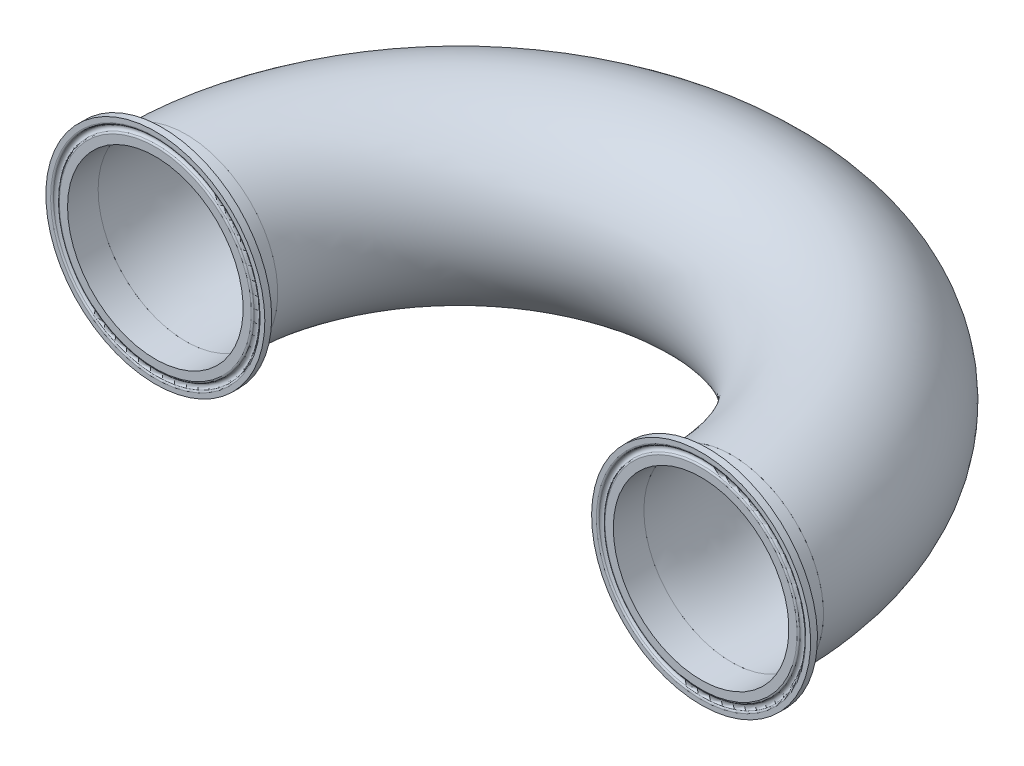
ISO-10303-21;
HEADER;
FILE_DESCRIPTION(('STEP AP214'),'2;1');
FILE_NAME('part.step','',(''),(''),'','','');
FILE_SCHEMA(('AUTOMOTIVE_DESIGN { 1 0 10303 214 1 1 1 1 }'));
ENDSEC;
DATA;
#1=APPLICATION_CONTEXT('core data for automotive mechanical design processes');
#2=APPLICATION_PROTOCOL_DEFINITION('international standard','automotive_design',2000,#1);
#3=PRODUCT_CONTEXT('',#1,'mechanical');
#4=PRODUCT('Part','Part','',(#3));
#5=PRODUCT_RELATED_PRODUCT_CATEGORY('part','',(#4));
#6=PRODUCT_DEFINITION_FORMATION('','',#4);
#7=PRODUCT_DEFINITION_CONTEXT('part definition',#1,'design');
#8=PRODUCT_DEFINITION('design','',#6,#7);
#9=PRODUCT_DEFINITION_SHAPE('','',#8);
#10=(LENGTH_UNIT() NAMED_UNIT(*) SI_UNIT(.MILLI.,.METRE.));
#11=(NAMED_UNIT(*) PLANE_ANGLE_UNIT() SI_UNIT($,.RADIAN.));
#12=(NAMED_UNIT(*) SI_UNIT($,.STERADIAN.) SOLID_ANGLE_UNIT());
#13=UNCERTAINTY_MEASURE_WITH_UNIT(LENGTH_MEASURE(1.E-05),#10,'distance_accuracy_value','');
#14=(GEOMETRIC_REPRESENTATION_CONTEXT(3) GLOBAL_UNCERTAINTY_ASSIGNED_CONTEXT((#13)) GLOBAL_UNIT_ASSIGNED_CONTEXT((#10,
#11,#12)) REPRESENTATION_CONTEXT('',''));
#15=CARTESIAN_POINT('',(0.,0.,0.));
#16=DIRECTION('',(0.,0.,1.));
#17=DIRECTION('',(1.,0.,0.));
#18=AXIS2_PLACEMENT_3D('',#15,#16,#17);
#19=CARTESIAN_POINT('',(-15.1247017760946,141.014622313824,192.088696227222));
#20=DIRECTION('',(0.,0.,-1.));
#21=DIRECTION('',(-1.,0.,0.));
#22=AXIS2_PLACEMENT_3D('',#19,#20,#21);
#23=CIRCLE('',#22,38.1);
#24=CARTESIAN_POINT('',(99.1707192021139,141.014622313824,193.11180101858));
#25=DIRECTION('',(0.,-1.,0.));
#26=AXIS1_PLACEMENT('',#24,#25);
#27=SURFACE_OF_REVOLUTION('',#23,#26);
#28=CARTESIAN_POINT('',(-53.2247017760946,141.014622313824,192.088696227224));
#29=VERTEX_POINT('',#28);
#30=EDGE_CURVE('P0_E10',#29,#29,#23,.T.);
#31=ORIENTED_EDGE('',*,*,#30,.T.);
#32=EDGE_LOOP('',(#31));
#33=FACE_BOUND('',#32,.T.);
#34=CARTESIAN_POINT('',(213.466140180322,141.014622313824,194.134905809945));
#35=DIRECTION('',(0.,0.,1.));
#36=DIRECTION('',(1.,0.,0.));
#37=AXIS2_PLACEMENT_3D('',#34,#35,#36);
#38=CIRCLE('',#37,38.1);
#39=CARTESIAN_POINT('',(251.566140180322,141.014622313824,194.134905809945));
#40=VERTEX_POINT('',#39);
#41=EDGE_CURVE('P0_E22',#40,#40,#38,.T.);
#42=ORIENTED_EDGE('',*,*,#41,.F.);
#43=EDGE_LOOP('',(#42));
#44=FACE_BOUND('',#43,.T.);
#45=ADVANCED_FACE('P0_F15',(#33,#44),#27,.F.);
#46=CARTESIAN_POINT('',(-15.1247017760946,141.014622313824,192.088696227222));
#47=DIRECTION('',(0.,0.,-1.));
#48=DIRECTION('',(-1.,0.,0.));
#49=AXIS2_PLACEMENT_3D('',#46,#47,#48);
#50=PLANE('',#49);
#51=CARTESIAN_POINT('',(21.3241525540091,141.014622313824,192.088696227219));
#52=CARTESIAN_POINT('',(21.3241599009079,139.990570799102,192.088696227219));
#53=CARTESIAN_POINT('',(21.2809783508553,138.966639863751,192.088696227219));
#54=CARTESIAN_POINT('',(21.1085535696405,136.925714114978,192.088696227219));
#55=CARTESIAN_POINT('',(20.9792876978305,135.908721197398,192.088696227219));
#56=CARTESIAN_POINT('',(20.6353902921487,133.88812912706,192.088696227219));
#57=CARTESIAN_POINT('',(20.4206643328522,132.884546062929,192.088696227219));
#58=CARTESIAN_POINT('',(19.9073961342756,130.899113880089,192.08869622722));
#59=CARTESIAN_POINT('',(19.6088594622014,129.917263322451,192.08869622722));
#60=CARTESIAN_POINT('',(18.9302418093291,127.982659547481,192.08869622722));
#61=CARTESIAN_POINT('',(18.5501977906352,127.029893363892,192.08869622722));
#62=CARTESIAN_POINT('',(17.7111815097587,125.159752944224,192.08869622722));
#63=CARTESIAN_POINT('',(17.252208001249,124.242379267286,192.08869622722));
#64=CARTESIAN_POINT('',(16.2587274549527,122.449792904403,192.08869622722));
#65=CARTESIAN_POINT('',(15.724239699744,121.574569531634,192.08869622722));
#66=CARTESIAN_POINT('',(14.5834435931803,119.872257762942,192.08869622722));
#67=CARTESIAN_POINT('',(13.9771355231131,119.045169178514,192.08869622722));
#68=CARTESIAN_POINT('',(12.6969414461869,117.444920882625,192.08869622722));
#69=CARTESIAN_POINT('',(12.0230485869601,116.671766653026,192.08869622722));
#70=CARTESIAN_POINT('',(10.6125262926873,115.184975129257,192.08869622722));
#71=CARTESIAN_POINT('',(9.87589679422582,114.471337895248,192.08869622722));
#72=CARTESIAN_POINT('',(8.34510877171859,113.108628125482,192.08869622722));
#73=CARTESIAN_POINT('',(7.55094801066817,112.459558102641,192.08869622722));
#74=CARTESIAN_POINT('',(5.91076923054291,111.230629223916,192.08869622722));
#75=CARTESIAN_POINT('',(5.06475122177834,110.65077035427,192.08869622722));
#76=CARTESIAN_POINT('',(3.32689369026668,109.564399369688,192.088696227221));
#77=CARTESIAN_POINT('',(2.43505526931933,109.057885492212,192.088696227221));
#78=CARTESIAN_POINT('',(0.611878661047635,108.121788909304,192.088696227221));
#79=CARTESIAN_POINT('',(-0.319459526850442,107.692206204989,192.088696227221));
#80=CARTESIAN_POINT('',(-2.21501243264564,106.91302684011,192.088696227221));
#81=CARTESIAN_POINT('',(-3.17922708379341,106.563430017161,192.088696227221));
#82=CARTESIAN_POINT('',(-5.13367971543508,105.94670668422,192.088696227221));
#83=CARTESIAN_POINT('',(-6.12391769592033,105.6795801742,192.088696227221));
#84=CARTESIAN_POINT('',(-8.12337820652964,105.229696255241,192.088696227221));
#85=CARTESIAN_POINT('',(-9.13260075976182,105.046938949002,192.088696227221));
#86=CARTESIAN_POINT('',(-11.1628542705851,104.767093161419,192.088696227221));
#87=CARTESIAN_POINT('',(-12.1838852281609,104.670004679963,192.088696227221));
#88=CARTESIAN_POINT('',(-14.2304947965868,104.562186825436,192.088696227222));
#89=CARTESIAN_POINT('',(-15.2560733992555,104.551457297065,192.088696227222));
#90=CARTESIAN_POINT('',(-17.3044888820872,104.616433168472,192.088696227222));
#91=CARTESIAN_POINT('',(-18.3273257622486,104.692138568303,192.088696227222));
#92=CARTESIAN_POINT('',(-20.3629885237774,104.929446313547,192.088696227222));
#93=CARTESIAN_POINT('',(-21.3758143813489,105.091048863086,192.088696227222));
#94=CARTESIAN_POINT('',(-23.3842520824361,105.499002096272,192.088696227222));
#95=CARTESIAN_POINT('',(-24.3798639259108,105.745352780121,192.088696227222));
#96=CARTESIAN_POINT('',(-26.346796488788,106.321051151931,192.088696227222));
#97=CARTESIAN_POINT('',(-27.3181171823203,106.650398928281,192.088696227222));
#98=CARTESIAN_POINT('',(-29.2295608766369,107.389749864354,192.088696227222));
#99=CARTESIAN_POINT('',(-30.1696838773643,107.799753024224,192.088696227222));
#100=CARTESIAN_POINT('',(-32.012050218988,108.697500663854,192.088696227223));
#101=CARTESIAN_POINT('',(-32.9142934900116,109.185245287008,192.088696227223));
#102=CARTESIAN_POINT('',(-34.6744841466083,110.235007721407,192.088696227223));
#103=CARTESIAN_POINT('',(-35.5324315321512,110.797025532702,192.088696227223));
#104=CARTESIAN_POINT('',(-37.197930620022,111.991338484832,192.088696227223));
#105=CARTESIAN_POINT('',(-38.005482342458,112.623633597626,192.088696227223));
#106=CARTESIAN_POINT('',(-39.5644493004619,113.954006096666,192.088696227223));
#107=CARTESIAN_POINT('',(-40.3158645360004,114.652083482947,192.088696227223));
#108=CARTESIAN_POINT('',(-41.7572175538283,116.109058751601,192.088696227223));
#109=CARTESIAN_POINT('',(-42.4471552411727,116.867956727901,192.088696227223));
#110=CARTESIAN_POINT('',(-43.7606468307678,118.44117692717,192.088696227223));
#111=CARTESIAN_POINT('',(-44.3842007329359,119.25549915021,192.088696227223));
#112=CARTESIAN_POINT('',(-45.5604917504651,120.933778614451,192.088696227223));
#113=CARTESIAN_POINT('',(-46.1132288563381,121.797735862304,192.088696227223));
#114=CARTESIAN_POINT('',(-47.1439565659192,123.569143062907,192.088696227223));
#115=CARTESIAN_POINT('',(-47.6219471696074,124.476593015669,192.088696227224));
#116=CARTESIAN_POINT('',(-48.4997839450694,126.328534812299,192.088696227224));
#117=CARTESIAN_POINT('',(-48.8996300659,127.273026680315,192.088696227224));
#118=CARTESIAN_POINT('',(-49.6183348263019,129.192336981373,192.088696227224));
#119=CARTESIAN_POINT('',(-49.9371934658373,130.167155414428,192.088696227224));
#120=CARTESIAN_POINT('',(-50.4916563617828,132.14018842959,192.088696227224));
#121=CARTESIAN_POINT('',(-50.7272606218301,133.138403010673,192.088696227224));
#122=CARTESIAN_POINT('',(-51.113539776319,135.15113165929,192.088696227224));
#123=CARTESIAN_POINT('',(-51.2642146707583,136.165645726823,192.088696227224));
#124=CARTESIAN_POINT('',(-51.4795639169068,138.203761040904,192.088696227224));
#125=CARTESIAN_POINT('',(-51.5442382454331,139.227362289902,192.088696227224));
#126=CARTESIAN_POINT('',(-51.587126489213,141.276374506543,192.088696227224));
#127=CARTESIAN_POINT('',(-51.5653404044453,142.301785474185,192.088696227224));
#128=CARTESIAN_POINT('',(-51.4354627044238,144.347127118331,192.088696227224));
#129=CARTESIAN_POINT('',(-51.3273710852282,145.367057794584,192.088696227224));
#130=CARTESIAN_POINT('',(-51.0256507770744,147.394187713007,192.088696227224));
#131=CARTESIAN_POINT('',(-50.8320220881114,148.401386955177,192.088696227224));
#132=CARTESIAN_POINT('',(-50.360604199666,150.395893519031,192.088696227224));
#133=CARTESIAN_POINT('',(-50.0828149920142,151.383200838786,192.088696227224));
#134=CARTESIAN_POINT('',(-49.4450509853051,153.330904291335,192.088696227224));
#135=CARTESIAN_POINT('',(-49.0850761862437,154.291300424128,192.088696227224));
#136=CARTESIAN_POINT('',(-48.2855002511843,156.178353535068,192.088696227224));
#137=CARTESIAN_POINT('',(-47.8458991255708,157.105010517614,192.088696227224));
#138=CARTESIAN_POINT('',(-46.8901958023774,158.917997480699,192.088696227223));
#139=CARTESIAN_POINT('',(-46.3740936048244,159.804327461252,192.088696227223));
#140=CARTESIAN_POINT('',(-45.2690574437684,161.530358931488,192.088696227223));
#141=CARTESIAN_POINT('',(-44.6801234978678,162.370060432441,192.088696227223));
#142=CARTESIAN_POINT('',(-43.4336107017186,163.996865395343,192.088696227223));
#143=CARTESIAN_POINT('',(-42.7760318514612,164.783968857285,192.088696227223));
#144=CARTESIAN_POINT('',(-41.3969039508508,166.299982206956,192.088696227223));
#145=CARTESIAN_POINT('',(-40.6753548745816,167.02889207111,192.088696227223));
#146=CARTESIAN_POINT('',(-39.1734165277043,168.423335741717,192.088696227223));
#147=CARTESIAN_POINT('',(-38.39302725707,169.088869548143,192.088696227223));
#148=CARTESIAN_POINT('',(-36.778956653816,170.351829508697,192.088696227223));
#149=CARTESIAN_POINT('',(-35.9452753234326,170.949255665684,192.088696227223));
#150=CARTESIAN_POINT('',(-34.2305475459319,172.07175299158,192.088696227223));
#151=CARTESIAN_POINT('',(-33.3495010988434,172.596824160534,192.088696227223));
#152=CARTESIAN_POINT('',(-31.5463077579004,173.570878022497,192.088696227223));
#153=CARTESIAN_POINT('',(-30.6241609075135,174.019860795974,192.088696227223));
#154=CARTESIAN_POINT('',(-28.7453217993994,174.838546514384,192.088696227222));
#155=CARTESIAN_POINT('',(-27.788629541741,175.208249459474,192.088696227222));
#156=CARTESIAN_POINT('',(-25.8475023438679,175.865746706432,192.088696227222));
#157=CARTESIAN_POINT('',(-24.8630674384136,176.153541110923,192.088696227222));
#158=CARTESIAN_POINT('',(-22.8734525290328,176.645175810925,192.088696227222));
#159=CARTESIAN_POINT('',(-21.8682725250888,176.849016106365,192.088696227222));
#160=CARTESIAN_POINT('',(-19.8443118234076,177.171293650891,192.088696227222));
#161=CARTESIAN_POINT('',(-18.8255311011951,177.289730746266,192.088696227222));
#162=CARTESIAN_POINT('',(-16.7816136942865,177.440359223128,192.088696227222));
#163=CARTESIAN_POINT('',(-15.7564770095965,177.472550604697,192.088696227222));
#164=CARTESIAN_POINT('',(-13.7071394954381,177.450458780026,192.088696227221));
#165=CARTESIAN_POINT('',(-12.6829386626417,177.396175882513,192.088696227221));
#166=CARTESIAN_POINT('',(-10.6427506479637,177.201521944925,192.088696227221));
#167=CARTESIAN_POINT('',(-9.6267634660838,177.061150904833,192.088696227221));
#168=CARTESIAN_POINT('',(-7.61022380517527,176.695318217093,192.088696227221));
#169=CARTESIAN_POINT('',(-6.60967135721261,176.469856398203,192.088696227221));
#170=CARTESIAN_POINT('',(-4.63111667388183,175.935445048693,192.088696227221));
#171=CARTESIAN_POINT('',(-3.65311443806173,175.626495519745,192.088696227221));
#172=CARTESIAN_POINT('',(-1.72659754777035,174.92729947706,192.088696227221));
#173=CARTESIAN_POINT('',(-0.778083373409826,174.537051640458,192.088696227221));
#174=CARTESIAN_POINT('',(1.0826972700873,173.67803645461,192.088696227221));
#175=CARTESIAN_POINT('',(1.99496373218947,173.209269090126,192.088696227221));
#176=CARTESIAN_POINT('',(3.77672807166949,172.196567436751,192.08869622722));
#177=CARTESIAN_POINT('',(4.64622761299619,171.652636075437,192.08869622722));
#178=CARTESIAN_POINT('',(6.33631393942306,170.493460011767,192.08869622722));
#179=CARTESIAN_POINT('',(7.15690077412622,169.878215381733,192.08869622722));
#180=CARTESIAN_POINT('',(8.74324340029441,168.580856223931,192.08869622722));
#181=CARTESIAN_POINT('',(9.50900509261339,167.898748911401,192.08869622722));
#182=CARTESIAN_POINT('',(10.9803549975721,166.47245432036,192.08869622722));
#183=CARTESIAN_POINT('',(11.6859429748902,165.728266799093,192.08869622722));
#184=CARTESIAN_POINT('',(13.0320988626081,164.182906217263,192.08869622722));
#185=CARTESIAN_POINT('',(13.6726501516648,163.381718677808,192.08869622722));
#186=CARTESIAN_POINT('',(14.8839629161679,161.728237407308,192.08869622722));
#187=CARTESIAN_POINT('',(15.4547254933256,160.875944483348,192.08869622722));
#188=CARTESIAN_POINT('',(16.5226574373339,159.125901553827,192.08869622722));
#189=CARTESIAN_POINT('',(17.0197931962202,158.228131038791,192.08869622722));
#190=CARTESIAN_POINT('',(17.9366527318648,156.393824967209,192.08869622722));
#191=CARTESIAN_POINT('',(18.3563713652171,155.457286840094,192.08869622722));
#192=CARTESIAN_POINT('',(19.1149503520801,153.553201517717,192.08869622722));
#193=CARTESIAN_POINT('',(19.4538996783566,152.58568978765,192.08869622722));
#194=CARTESIAN_POINT('',(20.0490443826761,150.625884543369,192.088696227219));
#195=CARTESIAN_POINT('',(20.3052615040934,149.633597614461,192.088696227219));
#196=CARTESIAN_POINT('',(20.7865367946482,147.381512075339,192.088696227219));
#197=CARTESIAN_POINT('',(20.9879716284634,146.116595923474,192.088696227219));
#198=CARTESIAN_POINT('',(21.2567749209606,143.57259793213,192.088696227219));
#199=CARTESIAN_POINT('',(21.324143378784,142.293516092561,192.088696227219));
#200=CARTESIAN_POINT('',(21.3241525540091,141.014622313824,192.088696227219));
#201=B_SPLINE_CURVE_WITH_KNOTS('',3,(#51,#52,#53,#54,#55,#56,#57,#58,#59,#60,#61,#62,#63,#64,
#65,#66,#67,#68,#69,#70,#71,#72,#73,#74,#75,#76,#77,#78,#79,#80,#81,#82,#83,#84,#85,#86,#87,#88,
#89,#90,#91,#92,#93,#94,#95,#96,#97,#98,#99,#100,#101,#102,#103,#104,#105,#106,#107,#108,#109,
#110,#111,#112,#113,#114,#115,#116,#117,#118,#119,#120,#121,#122,#123,#124,#125,#126,#127,#128,
#129,#130,#131,#132,#133,#134,#135,#136,#137,#138,#139,#140,#141,#142,#143,#144,#145,#146,#147,
#148,#149,#150,#151,#152,#153,#154,#155,#156,#157,#158,#159,#160,#161,#162,#163,#164,#165,#166,
#167,#168,#169,#170,#171,#172,#173,#174,#175,#176,#177,#178,#179,#180,#181,#182,#183,#184,#185,
#186,#187,#188,#189,#190,#191,#192,#193,#194,#195,#196,#197,#198,#199,#200),.UNSPECIFIED.,.T.,
.F.,(4,2,2,2,2,2,2,2,2,2,2,2,2,2,2,2,2,2,2,2,2,2,2,2,2,2,2,2,2,2,2,2,2,2,2,2,2,2,2,2,2,2,2,2,2,
2,2,2,2,2,2,2,2,2,2,2,2,2,2,2,2,2,2,2,2,2,2,2,2,2,2,2,2,2,4),(0.,3.07103743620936,
6.14288289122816,9.21813191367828,12.2931767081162,15.3668299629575,18.4405317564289,
21.5134500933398,24.5863563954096,27.6595745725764,30.7327958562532,33.8061367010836,
36.8794769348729,39.9527433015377,43.0260097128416,46.0992698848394,49.1725300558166,
52.2457939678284,55.3190578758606,58.3923162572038,61.465574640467,64.5388403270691,
67.6121060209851,70.6853749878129,73.7586439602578,76.8319186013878,79.9051932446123,
82.978466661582,86.051740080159,89.1250182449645,92.1982964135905,95.2715749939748,
98.3448535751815,101.418134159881,104.491414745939,107.564695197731,110.637975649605,
113.711256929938,116.784538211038,119.857819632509,122.931101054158,126.004382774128,
129.077664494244,132.150945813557,135.224227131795,138.297507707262,141.370788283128,
144.444070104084,147.51735192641,150.59063361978,153.663915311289,156.73719375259,
159.810472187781,162.883746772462,165.957021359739,169.030301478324,172.103581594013,
175.176850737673,178.250119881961,181.323395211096,184.396670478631,187.46999575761,
190.543321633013,193.616527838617,196.68973092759,199.762602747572,202.835486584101,
205.909153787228,208.982772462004,212.057789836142,215.133011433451,218.204829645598,
221.275839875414,225.111126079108,228.946412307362),.UNSPECIFIED.);
#202=CARTESIAN_POINT('',(21.3241525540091,141.014622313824,192.088696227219));
#203=VERTEX_POINT('',#202);
#204=EDGE_CURVE('P0_E26',#203,#203,#201,.T.);
#205=ORIENTED_EDGE('',*,*,#204,.T.);
#206=EDGE_LOOP('',(#205));
#207=FACE_BOUND('',#206,.T.);
#208=ORIENTED_EDGE('',*,*,#30,.F.);
#209=EDGE_LOOP('',(#208));
#210=FACE_BOUND('',#209,.T.);
#211=ADVANCED_FACE('P0_F53',(#207,#210),#50,.F.);
#212=CARTESIAN_POINT('',(213.466140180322,141.014622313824,194.134905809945));
#213=DIRECTION('',(0.,0.,1.));
#214=DIRECTION('',(1.,0.,0.));
#215=AXIS2_PLACEMENT_3D('',#212,#213,#214);
#216=PLANE('',#215);
#217=CARTESIAN_POINT('',(177.017285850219,141.014622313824,194.134905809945));
#218=CARTESIAN_POINT('',(177.01727850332,139.990570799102,194.134905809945));
#219=CARTESIAN_POINT('',(177.060460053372,138.966639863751,194.134905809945));
#220=CARTESIAN_POINT('',(177.232884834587,136.925714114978,194.134905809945));
#221=CARTESIAN_POINT('',(177.362150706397,135.908721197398,194.134905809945));
#222=CARTESIAN_POINT('',(177.706048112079,133.88812912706,194.134905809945));
#223=CARTESIAN_POINT('',(177.920774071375,132.884546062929,194.134905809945));
#224=CARTESIAN_POINT('',(178.434042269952,130.899113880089,194.134905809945));
#225=CARTESIAN_POINT('',(178.732578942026,129.917263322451,194.134905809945));
#226=CARTESIAN_POINT('',(179.411196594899,127.982659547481,194.134905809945));
#227=CARTESIAN_POINT('',(179.791240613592,127.029893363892,194.134905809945));
#228=CARTESIAN_POINT('',(180.630256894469,125.159752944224,194.134905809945));
#229=CARTESIAN_POINT('',(181.089230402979,124.242379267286,194.134905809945));
#230=CARTESIAN_POINT('',(182.082710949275,122.449792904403,194.134905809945));
#231=CARTESIAN_POINT('',(182.617198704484,121.574569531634,194.134905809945));
#232=CARTESIAN_POINT('',(183.757994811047,119.872257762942,194.134905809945));
#233=CARTESIAN_POINT('',(184.364302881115,119.045169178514,194.134905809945));
#234=CARTESIAN_POINT('',(185.644496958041,117.444920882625,194.134905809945));
#235=CARTESIAN_POINT('',(186.318389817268,116.671766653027,194.134905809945));
#236=CARTESIAN_POINT('',(187.72891211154,115.184975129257,194.134905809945));
#237=CARTESIAN_POINT('',(188.465541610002,114.471337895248,194.134905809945));
#238=CARTESIAN_POINT('',(189.996329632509,113.108628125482,194.134905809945));
#239=CARTESIAN_POINT('',(190.79049039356,112.459558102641,194.134905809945));
#240=CARTESIAN_POINT('',(192.430669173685,111.230629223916,194.134905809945));
#241=CARTESIAN_POINT('',(193.276687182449,110.65077035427,194.134905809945));
#242=CARTESIAN_POINT('',(195.014544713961,109.564399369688,194.134905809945));
#243=CARTESIAN_POINT('',(195.906383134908,109.057885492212,194.134905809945));
#244=CARTESIAN_POINT('',(197.72955974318,108.121788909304,194.134905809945));
#245=CARTESIAN_POINT('',(198.660897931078,107.692206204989,194.134905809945));
#246=CARTESIAN_POINT('',(200.556450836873,106.91302684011,194.134905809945));
#247=CARTESIAN_POINT('',(201.520665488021,106.563430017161,194.134905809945));
#248=CARTESIAN_POINT('',(203.475118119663,105.94670668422,194.134905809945));
#249=CARTESIAN_POINT('',(204.465356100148,105.6795801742,194.134905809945));
#250=CARTESIAN_POINT('',(206.464816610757,105.229696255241,194.134905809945));
#251=CARTESIAN_POINT('',(207.47403916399,105.046938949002,194.134905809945));
#252=CARTESIAN_POINT('',(209.504292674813,104.767093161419,194.134905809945));
#253=CARTESIAN_POINT('',(210.525323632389,104.670004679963,194.134905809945));
#254=CARTESIAN_POINT('',(212.571933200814,104.562186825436,194.134905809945));
#255=CARTESIAN_POINT('',(213.597511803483,104.551457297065,194.134905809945));
#256=CARTESIAN_POINT('',(215.645927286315,104.616433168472,194.134905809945));
#257=CARTESIAN_POINT('',(216.668764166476,104.692138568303,194.134905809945));
#258=CARTESIAN_POINT('',(218.704426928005,104.929446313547,194.134905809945));
#259=CARTESIAN_POINT('',(219.717252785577,105.091048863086,194.134905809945));
#260=CARTESIAN_POINT('',(221.725690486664,105.499002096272,194.134905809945));
#261=CARTESIAN_POINT('',(222.721302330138,105.745352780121,194.134905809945));
#262=CARTESIAN_POINT('',(224.688234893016,106.321051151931,194.134905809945));
#263=CARTESIAN_POINT('',(225.659555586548,106.650398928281,194.134905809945));
#264=CARTESIAN_POINT('',(227.570999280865,107.389749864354,194.134905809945));
#265=CARTESIAN_POINT('',(228.511122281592,107.799753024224,194.134905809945));
#266=CARTESIAN_POINT('',(230.353488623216,108.697500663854,194.134905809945));
#267=CARTESIAN_POINT('',(231.255731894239,109.185245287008,194.134905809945));
#268=CARTESIAN_POINT('',(233.015922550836,110.235007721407,194.134905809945));
#269=CARTESIAN_POINT('',(233.873869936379,110.797025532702,194.134905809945));
#270=CARTESIAN_POINT('',(235.53936902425,111.991338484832,194.134905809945));
#271=CARTESIAN_POINT('',(236.346920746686,112.623633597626,194.134905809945));
#272=CARTESIAN_POINT('',(237.90588770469,113.954006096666,194.134905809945));
#273=CARTESIAN_POINT('',(238.657302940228,114.652083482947,194.134905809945));
#274=CARTESIAN_POINT('',(240.098655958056,116.109058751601,194.134905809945));
#275=CARTESIAN_POINT('',(240.7885936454,116.867956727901,194.134905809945));
#276=CARTESIAN_POINT('',(242.102085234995,118.44117692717,194.134905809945));
#277=CARTESIAN_POINT('',(242.725639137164,119.255499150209,194.134905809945));
#278=CARTESIAN_POINT('',(243.901930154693,120.933778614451,194.134905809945));
#279=CARTESIAN_POINT('',(244.454667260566,121.797735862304,194.134905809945));
#280=CARTESIAN_POINT('',(245.485394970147,123.569143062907,194.134905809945));
#281=CARTESIAN_POINT('',(245.963385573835,124.476593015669,194.134905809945));
#282=CARTESIAN_POINT('',(246.841222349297,126.328534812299,194.134905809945));
#283=CARTESIAN_POINT('',(247.241068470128,127.273026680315,194.134905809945));
#284=CARTESIAN_POINT('',(247.95977323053,129.192336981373,194.134905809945));
#285=CARTESIAN_POINT('',(248.278631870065,130.167155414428,194.134905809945));
#286=CARTESIAN_POINT('',(248.833094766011,132.140188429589,194.134905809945));
#287=CARTESIAN_POINT('',(249.068699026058,133.138403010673,194.134905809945));
#288=CARTESIAN_POINT('',(249.454978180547,135.15113165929,194.134905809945));
#289=CARTESIAN_POINT('',(249.605653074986,136.165645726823,194.134905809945));
#290=CARTESIAN_POINT('',(249.821002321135,138.203761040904,194.134905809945));
#291=CARTESIAN_POINT('',(249.885676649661,139.227362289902,194.134905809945));
#292=CARTESIAN_POINT('',(249.928564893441,141.276374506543,194.134905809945));
#293=CARTESIAN_POINT('',(249.906778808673,142.301785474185,194.134905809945));
#294=CARTESIAN_POINT('',(249.776901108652,144.347127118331,194.134905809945));
#295=CARTESIAN_POINT('',(249.668809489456,145.367057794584,194.134905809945));
#296=CARTESIAN_POINT('',(249.367089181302,147.394187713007,194.134905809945));
#297=CARTESIAN_POINT('',(249.173460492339,148.401386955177,194.134905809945));
#298=CARTESIAN_POINT('',(248.702042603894,150.395893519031,194.134905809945));
#299=CARTESIAN_POINT('',(248.424253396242,151.383200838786,194.134905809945));
#300=CARTESIAN_POINT('',(247.786489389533,153.330904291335,194.134905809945));
#301=CARTESIAN_POINT('',(247.426514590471,154.291300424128,194.134905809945));
#302=CARTESIAN_POINT('',(246.626938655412,156.178353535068,194.134905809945));
#303=CARTESIAN_POINT('',(246.187337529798,157.105010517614,194.134905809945));
#304=CARTESIAN_POINT('',(245.231634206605,158.917997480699,194.134905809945));
#305=CARTESIAN_POINT('',(244.715532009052,159.804327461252,194.134905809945));
#306=CARTESIAN_POINT('',(243.610495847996,161.530358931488,194.134905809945));
#307=CARTESIAN_POINT('',(243.021561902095,162.370060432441,194.134905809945));
#308=CARTESIAN_POINT('',(241.775049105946,163.996865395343,194.134905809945));
#309=CARTESIAN_POINT('',(241.117470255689,164.783968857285,194.134905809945));
#310=CARTESIAN_POINT('',(239.738342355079,166.299982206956,194.134905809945));
#311=CARTESIAN_POINT('',(239.016793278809,167.02889207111,194.134905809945));
#312=CARTESIAN_POINT('',(237.514854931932,168.423335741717,194.134905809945));
#313=CARTESIAN_POINT('',(236.734465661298,169.088869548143,194.134905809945));
#314=CARTESIAN_POINT('',(235.120395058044,170.351829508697,194.134905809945));
#315=CARTESIAN_POINT('',(234.28671372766,170.949255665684,194.134905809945));
#316=CARTESIAN_POINT('',(232.57198595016,172.07175299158,194.134905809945));
#317=CARTESIAN_POINT('',(231.690939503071,172.596824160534,194.134905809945));
#318=CARTESIAN_POINT('',(229.887746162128,173.570878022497,194.134905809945));
#319=CARTESIAN_POINT('',(228.965599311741,174.019860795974,194.134905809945));
#320=CARTESIAN_POINT('',(227.086760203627,174.838546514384,194.134905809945));
#321=CARTESIAN_POINT('',(226.130067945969,175.208249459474,194.134905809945));
#322=CARTESIAN_POINT('',(224.188940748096,175.865746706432,194.134905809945));
#323=CARTESIAN_POINT('',(223.204505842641,176.153541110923,194.134905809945));
#324=CARTESIAN_POINT('',(221.214890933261,176.645175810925,194.134905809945));
#325=CARTESIAN_POINT('',(220.209710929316,176.849016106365,194.134905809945));
#326=CARTESIAN_POINT('',(218.185750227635,177.171293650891,194.134905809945));
#327=CARTESIAN_POINT('',(217.166969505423,177.289730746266,194.134905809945));
#328=CARTESIAN_POINT('',(215.123052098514,177.440359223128,194.134905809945));
#329=CARTESIAN_POINT('',(214.097915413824,177.472550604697,194.134905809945));
#330=CARTESIAN_POINT('',(212.048577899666,177.450458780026,194.134905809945));
#331=CARTESIAN_POINT('',(211.024377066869,177.396175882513,194.134905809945));
#332=CARTESIAN_POINT('',(208.984189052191,177.201521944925,194.134905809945));
#333=CARTESIAN_POINT('',(207.968201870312,177.061150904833,194.134905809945));
#334=CARTESIAN_POINT('',(205.951662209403,176.695318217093,194.134905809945));
#335=CARTESIAN_POINT('',(204.95110976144,176.469856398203,194.134905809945));
#336=CARTESIAN_POINT('',(202.97255507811,175.935445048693,194.134905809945));
#337=CARTESIAN_POINT('',(201.994552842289,175.626495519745,194.134905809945));
#338=CARTESIAN_POINT('',(200.068035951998,174.92729947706,194.134905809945));
#339=CARTESIAN_POINT('',(199.119521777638,174.537051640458,194.134905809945));
#340=CARTESIAN_POINT('',(197.25874113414,173.67803645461,194.134905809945));
#341=CARTESIAN_POINT('',(196.346474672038,173.209269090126,194.134905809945));
#342=CARTESIAN_POINT('',(194.564710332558,172.196567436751,194.134905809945));
#343=CARTESIAN_POINT('',(193.695210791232,171.652636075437,194.134905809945));
#344=CARTESIAN_POINT('',(192.005124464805,170.493460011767,194.134905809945));
#345=CARTESIAN_POINT('',(191.184537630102,169.878215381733,194.134905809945));
#346=CARTESIAN_POINT('',(189.598195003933,168.580856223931,194.134905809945));
#347=CARTESIAN_POINT('',(188.832433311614,167.898748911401,194.134905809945));
#348=CARTESIAN_POINT('',(187.361083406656,166.47245432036,194.134905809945));
#349=CARTESIAN_POINT('',(186.655495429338,165.728266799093,194.134905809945));
#350=CARTESIAN_POINT('',(185.30933954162,164.182906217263,194.134905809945));
#351=CARTESIAN_POINT('',(184.668788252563,163.381718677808,194.134905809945));
#352=CARTESIAN_POINT('',(183.45747548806,161.728237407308,194.134905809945));
#353=CARTESIAN_POINT('',(182.886712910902,160.875944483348,194.134905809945));
#354=CARTESIAN_POINT('',(181.818780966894,159.125901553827,194.134905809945));
#355=CARTESIAN_POINT('',(181.321645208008,158.228131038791,194.134905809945));
#356=CARTESIAN_POINT('',(180.404785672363,156.393824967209,194.134905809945));
#357=CARTESIAN_POINT('',(179.985067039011,155.457286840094,194.134905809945));
#358=CARTESIAN_POINT('',(179.226488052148,153.553201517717,194.134905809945));
#359=CARTESIAN_POINT('',(178.887538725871,152.58568978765,194.134905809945));
#360=CARTESIAN_POINT('',(178.292394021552,150.625884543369,194.134905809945));
#361=CARTESIAN_POINT('',(178.036176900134,149.633597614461,194.134905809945));
#362=CARTESIAN_POINT('',(177.55490160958,147.381512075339,194.134905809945));
#363=CARTESIAN_POINT('',(177.353466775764,146.116595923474,194.134905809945));
#364=CARTESIAN_POINT('',(177.084663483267,143.57259793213,194.134905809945));
#365=CARTESIAN_POINT('',(177.017295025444,142.293516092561,194.134905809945));
#366=CARTESIAN_POINT('',(177.017285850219,141.014622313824,194.134905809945));
#367=B_SPLINE_CURVE_WITH_KNOTS('',3,(#217,#218,#219,#220,#221,#222,#223,#224,#225,#226,#227,
#228,#229,#230,#231,#232,#233,#234,#235,#236,#237,#238,#239,#240,#241,#242,#243,#244,#245,#246,
#247,#248,#249,#250,#251,#252,#253,#254,#255,#256,#257,#258,#259,#260,#261,#262,#263,#264,#265,
#266,#267,#268,#269,#270,#271,#272,#273,#274,#275,#276,#277,#278,#279,#280,#281,#282,#283,#284,
#285,#286,#287,#288,#289,#290,#291,#292,#293,#294,#295,#296,#297,#298,#299,#300,#301,#302,#303,
#304,#305,#306,#307,#308,#309,#310,#311,#312,#313,#314,#315,#316,#317,#318,#319,#320,#321,#322,
#323,#324,#325,#326,#327,#328,#329,#330,#331,#332,#333,#334,#335,#336,#337,#338,#339,#340,#341,
#342,#343,#344,#345,#346,#347,#348,#349,#350,#351,#352,#353,#354,#355,#356,#357,#358,#359,#360,
#361,#362,#363,#364,#365,#366),.UNSPECIFIED.,.T.,.F.,(4,2,2,2,2,2,2,2,2,2,2,2,2,2,2,2,2,2,2,2,2,
2,2,2,2,2,2,2,2,2,2,2,2,2,2,2,2,2,2,2,2,2,2,2,2,2,2,2,2,2,2,2,2,2,2,2,2,2,2,2,2,2,2,2,2,2,2,2,2,
2,2,2,2,2,4),(0.,3.07103743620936,6.14288289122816,9.21813191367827,12.2931767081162,
15.3668299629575,18.4405317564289,21.5134500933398,24.5863563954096,27.6595745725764,
30.7327958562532,33.8061367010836,36.8794769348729,39.9527433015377,43.0260097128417,
46.0992698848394,49.1725300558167,52.2457939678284,55.3190578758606,58.3923162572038,
61.465574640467,64.5388403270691,67.6121060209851,70.685374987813,73.7586439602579,
76.8319186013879,79.9051932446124,82.978466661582,86.051740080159,89.1250182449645,
92.1982964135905,95.2715749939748,98.3448535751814,101.418134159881,104.491414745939,
107.564695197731,110.637975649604,113.711256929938,116.784538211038,119.857819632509,
122.931101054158,126.004382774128,129.077664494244,132.150945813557,135.224227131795,
138.297507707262,141.370788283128,144.444070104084,147.51735192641,150.59063361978,
153.663915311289,156.73719375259,159.810472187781,162.883746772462,165.957021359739,
169.030301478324,172.103581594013,175.176850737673,178.250119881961,181.323395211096,
184.396670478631,187.46999575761,190.543321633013,193.616527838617,196.68973092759,
199.762602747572,202.835486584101,205.909153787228,208.982772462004,212.057789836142,
215.133011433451,218.204829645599,221.275839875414,225.111126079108,228.946412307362),.UNSPECIFIED.);
#368=CARTESIAN_POINT('',(177.017285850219,141.014622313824,194.134905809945));
#369=VERTEX_POINT('',#368);
#370=EDGE_CURVE('P0_E30',#369,#369,#367,.T.);
#371=ORIENTED_EDGE('',*,*,#370,.F.);
#372=EDGE_LOOP('',(#371));
#373=FACE_BOUND('',#372,.T.);
#374=ORIENTED_EDGE('',*,*,#41,.T.);
#375=EDGE_LOOP('',(#374));
#376=FACE_BOUND('',#375,.T.);
#377=ADVANCED_FACE('P0_F48',(#373,#376),#216,.T.);
#378=CARTESIAN_POINT('',(-15.1247017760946,141.014622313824,192.088696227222));
#379=DIRECTION('',(0.,0.,-1.));
#380=DIRECTION('',(-1.,0.,0.));
#381=AXIS2_PLACEMENT_3D('',#378,#379,#380);
#382=CIRCLE('',#381,38.1);
#383=CARTESIAN_POINT('',(99.1707192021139,141.014622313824,193.11180101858));
#384=DIRECTION('',(0.,-1.,0.));
#385=AXIS1_PLACEMENT('',#383,#384);
#386=SURFACE_OF_REVOLUTION('',#382,#385);
#387=OFFSET_SURFACE('',#386,1.651,.F.);
#388=ORIENTED_EDGE('',*,*,#204,.F.);
#389=EDGE_LOOP('',(#388));
#390=FACE_BOUND('',#389,.T.);
#391=ORIENTED_EDGE('',*,*,#370,.T.);
#392=EDGE_LOOP('',(#391));
#393=FACE_BOUND('',#392,.T.);
#394=ADVANCED_FACE('P0_F43',(#390,#393),#387,.T.);
#395=CLOSED_SHELL('',(#45,#211,#377,#394));
#396=MANIFOLD_SOLID_BREP('P0_B1',#395);
#397=CARTESIAN_POINT('',(213.466140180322,141.014622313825,206.047505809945));
#398=DIRECTION('',(0.,0.,1.00000000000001));
#399=DIRECTION('',(0.982887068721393,-0.184209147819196,0.));
#400=AXIS2_PLACEMENT_3D('',#397,#398,#399);
#401=TOROIDAL_SURFACE('',#400,43.4867084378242,0.787400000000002);
#402=CARTESIAN_POINT('',(213.466140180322,141.014622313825,206.834905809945));
#403=DIRECTION('',(0.,0.,1.00000000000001));
#404=DIRECTION('',(0.982887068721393,-0.184209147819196,0.));
#405=AXIS2_PLACEMENT_3D('',#402,#403,#404);
#406=CIRCLE('',#405,43.4867084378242);
#407=CARTESIAN_POINT('',(256.208663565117,133.003972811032,206.834905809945));
#408=VERTEX_POINT('',#407);
#409=EDGE_CURVE('P1_E48',#408,#408,#406,.T.);
#410=ORIENTED_EDGE('',*,*,#409,.T.);
#411=EDGE_LOOP('',(#410));
#412=FACE_BOUND('',#411,.T.);
#413=CARTESIAN_POINT('',(213.466140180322,141.014622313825,206.360446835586));
#414=DIRECTION('',(0.,0.,1.00000000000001));
#415=DIRECTION('',(0.982887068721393,-0.184209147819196,0.));
#416=AXIS2_PLACEMENT_3D('',#413,#414,#415);
#417=CIRCLE('',#416,42.7641666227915);
#418=CARTESIAN_POINT('',(255.49848655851,133.137071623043,206.360446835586));
#419=VERTEX_POINT('',#418);
#420=EDGE_CURVE('P1_E9',#419,#419,#417,.T.);
#421=ORIENTED_EDGE('',*,*,#420,.F.);
#422=EDGE_LOOP('',(#421));
#423=FACE_BOUND('',#422,.T.);
#424=ADVANCED_FACE('P1_F14',(#412,#423),#401,.T.);
#425=CARTESIAN_POINT('',(213.466140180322,141.014622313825,206.834905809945));
#426=DIRECTION('',(0.,0.,1.00000000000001));
#427=DIRECTION('',(0.982887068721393,-0.184209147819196,0.));
#428=AXIS2_PLACEMENT_3D('',#425,#426,#427);
#429=TOROIDAL_SURFACE('',#428,41.6687,1.1938);
#430=CARTESIAN_POINT('',(213.466140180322,141.014622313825,206.360446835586));
#431=DIRECTION('',(0.,0.,1.00000000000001));
#432=DIRECTION('',(0.982887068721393,-0.184209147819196,0.));
#433=AXIS2_PLACEMENT_3D('',#430,#431,#432);
#434=CIRCLE('',#433,40.5732333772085);
#435=CARTESIAN_POINT('',(253.345046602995,133.54066156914,206.360446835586));
#436=VERTEX_POINT('',#435);
#437=EDGE_CURVE('P1_E20',#436,#436,#434,.T.);
#438=ORIENTED_EDGE('',*,*,#437,.F.);
#439=EDGE_LOOP('',(#438));
#440=FACE_BOUND('',#439,.T.);
#441=ORIENTED_EDGE('',*,*,#420,.T.);
#442=EDGE_LOOP('',(#441));
#443=FACE_BOUND('',#442,.T.);
#444=ADVANCED_FACE('P1_F97',(#440,#443),#429,.F.);
#445=CARTESIAN_POINT('',(213.466140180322,141.014622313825,206.047505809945));
#446=DIRECTION('',(0.,0.,1.00000000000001));
#447=DIRECTION('',(0.982887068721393,-0.184209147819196,0.));
#448=AXIS2_PLACEMENT_3D('',#445,#446,#447);
#449=TOROIDAL_SURFACE('',#448,39.8506915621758,0.787399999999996);
#450=ORIENTED_EDGE('',*,*,#437,.T.);
#451=EDGE_LOOP('',(#450));
#452=FACE_BOUND('',#451,.T.);
#453=CARTESIAN_POINT('',(213.466140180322,141.014622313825,206.834905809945));
#454=DIRECTION('',(0.,0.,1.00000000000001));
#455=DIRECTION('',(0.982887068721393,-0.184209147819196,0.));
#456=AXIS2_PLACEMENT_3D('',#453,#454,#455);
#457=CIRCLE('',#456,39.8506915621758);
#458=CARTESIAN_POINT('',(252.63486959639,133.673760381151,206.834905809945));
#459=VERTEX_POINT('',#458);
#460=EDGE_CURVE('P1_E24',#459,#459,#457,.T.);
#461=ORIENTED_EDGE('',*,*,#460,.F.);
#462=EDGE_LOOP('',(#461));
#463=FACE_BOUND('',#462,.T.);
#464=ADVANCED_FACE('P1_F93',(#452,#463),#449,.T.);
#465=CARTESIAN_POINT('',(213.466140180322,141.014622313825,206.834905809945));
#466=DIRECTION('',(0.,0.,-1.00000000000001));
#467=DIRECTION('',(-0.982887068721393,0.184209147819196,0.));
#468=AXIS2_PLACEMENT_3D('',#465,#466,#467);
#469=PLANE('',#468);
#470=CARTESIAN_POINT('',(213.466140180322,141.014622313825,206.834905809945));
#471=DIRECTION('',(0.,0.,1.00000000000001));
#472=DIRECTION('',(0.982887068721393,-0.184209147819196,0.));
#473=AXIS2_PLACEMENT_3D('',#470,#471,#472);
#474=CIRCLE('',#473,36.449);
#475=CARTESIAN_POINT('',(249.291390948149,134.300383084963,206.834905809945));
#476=VERTEX_POINT('',#475);
#477=EDGE_CURVE('P1_E28',#476,#476,#474,.T.);
#478=ORIENTED_EDGE('',*,*,#477,.F.);
#479=EDGE_LOOP('',(#478));
#480=FACE_BOUND('',#479,.T.);
#481=ORIENTED_EDGE('',*,*,#460,.T.);
#482=EDGE_LOOP('',(#481));
#483=FACE_BOUND('',#482,.T.);
#484=ADVANCED_FACE('P1_F86',(#480,#483),#469,.F.);
#485=CARTESIAN_POINT('',(213.466140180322,141.014622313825,206.834905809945));
#486=DIRECTION('',(0.,0.,1.00000000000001));
#487=DIRECTION('',(0.982887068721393,-0.184209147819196,0.));
#488=AXIS2_PLACEMENT_3D('',#485,#486,#487);
#489=CYLINDRICAL_SURFACE('',#488,36.449);
#490=ORIENTED_EDGE('',*,*,#477,.T.);
#491=EDGE_LOOP('',(#490));
#492=FACE_BOUND('',#491,.T.);
#493=CARTESIAN_POINT('',(213.466140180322,141.014622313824,194.134905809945));
#494=DIRECTION('',(0.,0.,1.00000000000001));
#495=DIRECTION('',(0.982887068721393,-0.184209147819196,0.));
#496=AXIS2_PLACEMENT_3D('',#493,#494,#495);
#497=CIRCLE('',#496,36.449);
#498=CARTESIAN_POINT('',(249.291390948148,134.300383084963,194.134905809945));
#499=VERTEX_POINT('',#498);
#500=EDGE_CURVE('P1_E33',#499,#499,#497,.T.);
#501=ORIENTED_EDGE('',*,*,#500,.F.);
#502=EDGE_LOOP('',(#501));
#503=FACE_BOUND('',#502,.T.);
#504=ADVANCED_FACE('P1_F81',(#492,#503),#489,.F.);
#505=CARTESIAN_POINT('',(213.466140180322,141.014622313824,194.134905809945));
#506=DIRECTION('',(0.,0.,1.00000000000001));
#507=DIRECTION('',(0.982887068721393,-0.184209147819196,0.));
#508=AXIS2_PLACEMENT_3D('',#505,#506,#507);
#509=PLANE('',#508);
#510=CARTESIAN_POINT('',(213.466140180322,141.014622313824,194.134905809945));
#511=DIRECTION('',(0.,0.,1.00000000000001));
#512=DIRECTION('',(0.982887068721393,-0.184209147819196,0.));
#513=AXIS2_PLACEMENT_3D('',#510,#511,#512);
#514=CIRCLE('',#513,38.1);
#515=CARTESIAN_POINT('',(250.914137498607,133.996253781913,194.134905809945));
#516=VERTEX_POINT('',#515);
#517=EDGE_CURVE('P1_E36',#516,#516,#514,.T.);
#518=ORIENTED_EDGE('',*,*,#517,.F.);
#519=EDGE_LOOP('',(#518));
#520=FACE_BOUND('',#519,.T.);
#521=ORIENTED_EDGE('',*,*,#500,.T.);
#522=EDGE_LOOP('',(#521));
#523=FACE_BOUND('',#522,.T.);
#524=ADVANCED_FACE('P1_F75',(#520,#523),#509,.F.);
#525=CARTESIAN_POINT('',(213.466140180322,141.014622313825,206.834905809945));
#526=DIRECTION('',(0.,0.,1.00000000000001));
#527=DIRECTION('',(0.982887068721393,-0.184209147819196,0.));
#528=AXIS2_PLACEMENT_3D('',#525,#526,#527);
#529=CYLINDRICAL_SURFACE('',#528,38.1);
#530=CARTESIAN_POINT('',(213.466140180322,141.014622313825,201.313723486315));
#531=DIRECTION('',(0.,0.,1.00000000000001));
#532=DIRECTION('',(0.982887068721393,-0.184209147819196,0.));
#533=AXIS2_PLACEMENT_3D('',#530,#531,#532);
#534=CIRCLE('',#533,38.1);
#535=CARTESIAN_POINT('',(250.914137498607,133.996253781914,201.313723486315));
#536=VERTEX_POINT('',#535);
#537=EDGE_CURVE('P1_E39',#536,#536,#534,.T.);
#538=ORIENTED_EDGE('',*,*,#537,.F.);
#539=EDGE_LOOP('',(#538));
#540=FACE_BOUND('',#539,.T.);
#541=ORIENTED_EDGE('',*,*,#517,.T.);
#542=EDGE_LOOP('',(#541));
#543=FACE_BOUND('',#542,.T.);
#544=ADVANCED_FACE('P1_F69',(#540,#543),#529,.T.);
#545=CARTESIAN_POINT('',(213.466140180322,141.014622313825,201.313723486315));
#546=DIRECTION('',(0.,0.,1.00000000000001));
#547=DIRECTION('',(0.982887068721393,-0.184209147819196,0.));
#548=AXIS2_PLACEMENT_3D('',#545,#546,#547);
#549=CONICAL_SURFACE('',#548,38.1,1.22173047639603);
#550=CARTESIAN_POINT('',(213.466140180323,141.014622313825,203.990105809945));
#551=DIRECTION('',(0.,0.,1.00000000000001));
#552=DIRECTION('',(0.982887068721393,-0.184209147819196,0.));
#553=AXIS2_PLACEMENT_3D('',#550,#551,#552);
#554=CIRCLE('',#553,45.4533);
#555=CARTESIAN_POINT('',(258.141600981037,132.641708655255,203.990105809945));
#556=VERTEX_POINT('',#555);
#557=EDGE_CURVE('P1_E42',#556,#556,#554,.T.);
#558=ORIENTED_EDGE('',*,*,#557,.F.);
#559=EDGE_LOOP('',(#558));
#560=FACE_BOUND('',#559,.T.);
#561=ORIENTED_EDGE('',*,*,#537,.T.);
#562=EDGE_LOOP('',(#561));
#563=FACE_BOUND('',#562,.T.);
#564=ADVANCED_FACE('P1_F63',(#560,#563),#549,.T.);
#565=CARTESIAN_POINT('',(213.466140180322,141.014622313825,206.834905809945));
#566=DIRECTION('',(0.,0.,1.00000000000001));
#567=DIRECTION('',(0.982887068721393,-0.184209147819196,0.));
#568=AXIS2_PLACEMENT_3D('',#565,#566,#567);
#569=CYLINDRICAL_SURFACE('',#568,45.4533);
#570=CARTESIAN_POINT('',(213.466140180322,141.014622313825,206.834905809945));
#571=DIRECTION('',(0.,0.,1.00000000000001));
#572=DIRECTION('',(0.982887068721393,-0.184209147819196,0.));
#573=AXIS2_PLACEMENT_3D('',#570,#571,#572);
#574=CIRCLE('',#573,45.4533);
#575=CARTESIAN_POINT('',(258.141600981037,132.641708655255,206.834905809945));
#576=VERTEX_POINT('',#575);
#577=EDGE_CURVE('P1_E45',#576,#576,#574,.T.);
#578=ORIENTED_EDGE('',*,*,#577,.F.);
#579=EDGE_LOOP('',(#578));
#580=FACE_BOUND('',#579,.T.);
#581=ORIENTED_EDGE('',*,*,#557,.T.);
#582=EDGE_LOOP('',(#581));
#583=FACE_BOUND('',#582,.T.);
#584=ADVANCED_FACE('P1_F57',(#580,#583),#569,.T.);
#585=CARTESIAN_POINT('',(213.466140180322,141.014622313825,206.834905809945));
#586=DIRECTION('',(0.,0.,-1.00000000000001));
#587=DIRECTION('',(-0.982887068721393,0.184209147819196,0.));
#588=AXIS2_PLACEMENT_3D('',#585,#586,#587);
#589=PLANE('',#588);
#590=ORIENTED_EDGE('',*,*,#409,.F.);
#591=EDGE_LOOP('',(#590));
#592=FACE_BOUND('',#591,.T.);
#593=ORIENTED_EDGE('',*,*,#577,.T.);
#594=EDGE_LOOP('',(#593));
#595=FACE_BOUND('',#594,.T.);
#596=ADVANCED_FACE('P1_F54',(#592,#595),#589,.F.);
#597=CLOSED_SHELL('',(#424,#444,#464,#484,#504,#524,#544,#564,#584,#596));
#598=MANIFOLD_SOLID_BREP('P1_B1',#597);
#599=CARTESIAN_POINT('',(-15.1247017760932,141.014622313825,204.001296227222));
#600=DIRECTION('',(0.,0.,1.00000000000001));
#601=DIRECTION('',(0.776387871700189,-0.630255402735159,0.));
#602=AXIS2_PLACEMENT_3D('',#599,#600,#601);
#603=TOROIDAL_SURFACE('',#602,43.4867084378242,0.787400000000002);
#604=CARTESIAN_POINT('',(-15.1247017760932,141.014622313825,204.788696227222));
#605=DIRECTION('',(0.,0.,1.00000000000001));
#606=DIRECTION('',(0.776387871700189,-0.630255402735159,0.));
#607=AXIS2_PLACEMENT_3D('',#604,#605,#606);
#608=CIRCLE('',#607,43.4867084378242);
#609=CARTESIAN_POINT('',(18.6378512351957,113.606889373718,204.78869622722));
#610=VERTEX_POINT('',#609);
#611=EDGE_CURVE('P2_E49',#610,#610,#608,.T.);
#612=ORIENTED_EDGE('',*,*,#611,.T.);
#613=EDGE_LOOP('',(#612));
#614=FACE_BOUND('',#613,.T.);
#615=CARTESIAN_POINT('',(-15.124701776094,141.014622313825,204.314237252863));
#616=DIRECTION('',(0.,0.,1.00000000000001));
#617=DIRECTION('',(0.776387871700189,-0.630255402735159,0.));
#618=AXIS2_PLACEMENT_3D('',#615,#616,#617);
#619=CIRCLE('',#618,42.7641666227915);
#620=CARTESIAN_POINT('',(18.0768785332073,114.062275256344,204.314237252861));
#621=VERTEX_POINT('',#620);
#622=EDGE_CURVE('P2_E10',#621,#621,#619,.T.);
#623=ORIENTED_EDGE('',*,*,#622,.F.);
#624=EDGE_LOOP('',(#623));
#625=FACE_BOUND('',#624,.T.);
#626=ADVANCED_FACE('P2_F15',(#614,#625),#603,.T.);
#627=CARTESIAN_POINT('',(-15.1247017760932,141.014622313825,204.788696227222));
#628=DIRECTION('',(0.,0.,1.00000000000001));
#629=DIRECTION('',(0.776387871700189,-0.630255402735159,0.));
#630=AXIS2_PLACEMENT_3D('',#627,#628,#629);
#631=TOROIDAL_SURFACE('',#630,41.6687,1.1938);
#632=CARTESIAN_POINT('',(-15.124701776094,141.014622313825,204.314237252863));
#633=DIRECTION('',(0.,0.,1.00000000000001));
#634=DIRECTION('',(0.776387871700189,-0.630255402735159,0.));
#635=AXIS2_PLACEMENT_3D('',#632,#633,#634);
#636=CIRCLE('',#635,40.5732333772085);
#637=CARTESIAN_POINT('',(16.3758645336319,115.443122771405,204.314237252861));
#638=VERTEX_POINT('',#637);
#639=EDGE_CURVE('P2_E21',#638,#638,#636,.T.);
#640=ORIENTED_EDGE('',*,*,#639,.F.);
#641=EDGE_LOOP('',(#640));
#642=FACE_BOUND('',#641,.T.);
#643=ORIENTED_EDGE('',*,*,#622,.T.);
#644=EDGE_LOOP('',(#643));
#645=FACE_BOUND('',#644,.T.);
#646=ADVANCED_FACE('P2_F98',(#642,#645),#631,.F.);
#647=CARTESIAN_POINT('',(-15.1247017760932,141.014622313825,204.001296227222));
#648=DIRECTION('',(0.,0.,1.00000000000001));
#649=DIRECTION('',(0.776387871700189,-0.630255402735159,0.));
#650=AXIS2_PLACEMENT_3D('',#647,#648,#649);
#651=TOROIDAL_SURFACE('',#650,39.8506915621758,0.787399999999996);
#652=ORIENTED_EDGE('',*,*,#639,.T.);
#653=EDGE_LOOP('',(#652));
#654=FACE_BOUND('',#653,.T.);
#655=CARTESIAN_POINT('',(-15.1247017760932,141.014622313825,204.788696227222));
#656=DIRECTION('',(0.,0.,1.00000000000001));
#657=DIRECTION('',(0.776387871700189,-0.630255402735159,0.));
#658=AXIS2_PLACEMENT_3D('',#655,#656,#657);
#659=CIRCLE('',#658,39.8506915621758);
#660=CARTESIAN_POINT('',(15.8148918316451,115.898508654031,204.78869622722));
#661=VERTEX_POINT('',#660);
#662=EDGE_CURVE('P2_E25',#661,#661,#659,.T.);
#663=ORIENTED_EDGE('',*,*,#662,.F.);
#664=EDGE_LOOP('',(#663));
#665=FACE_BOUND('',#664,.T.);
#666=ADVANCED_FACE('P2_F94',(#654,#665),#651,.T.);
#667=CARTESIAN_POINT('',(-15.1247017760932,141.014622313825,204.788696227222));
#668=DIRECTION('',(0.,0.,-1.00000000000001));
#669=DIRECTION('',(-0.776387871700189,0.630255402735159,0.));
#670=AXIS2_PLACEMENT_3D('',#667,#668,#669);
#671=PLANE('',#670);
#672=CARTESIAN_POINT('',(-15.1247017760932,141.014622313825,204.788696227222));
#673=DIRECTION('',(0.,0.,1.00000000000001));
#674=DIRECTION('',(0.776387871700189,-0.630255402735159,0.));
#675=AXIS2_PLACEMENT_3D('',#672,#673,#674);
#676=CIRCLE('',#675,36.449);
#677=CARTESIAN_POINT('',(13.1738597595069,118.042443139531,204.78869622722));
#678=VERTEX_POINT('',#677);
#679=EDGE_CURVE('P2_E29',#678,#678,#676,.T.);
#680=ORIENTED_EDGE('',*,*,#679,.F.);
#681=EDGE_LOOP('',(#680));
#682=FACE_BOUND('',#681,.T.);
#683=ORIENTED_EDGE('',*,*,#662,.T.);
#684=EDGE_LOOP('',(#683));
#685=FACE_BOUND('',#684,.T.);
#686=ADVANCED_FACE('P2_F87',(#682,#685),#671,.F.);
#687=CARTESIAN_POINT('',(-15.1247017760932,141.014622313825,204.788696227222));
#688=DIRECTION('',(0.,0.,1.00000000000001));
#689=DIRECTION('',(0.776387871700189,-0.630255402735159,0.));
#690=AXIS2_PLACEMENT_3D('',#687,#688,#689);
#691=CYLINDRICAL_SURFACE('',#690,36.449);
#692=ORIENTED_EDGE('',*,*,#679,.T.);
#693=EDGE_LOOP('',(#692));
#694=FACE_BOUND('',#693,.T.);
#695=CARTESIAN_POINT('',(-15.1247017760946,141.014622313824,192.088696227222));
#696=DIRECTION('',(0.,0.,1.00000000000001));
#697=DIRECTION('',(0.776387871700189,-0.630255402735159,0.));
#698=AXIS2_PLACEMENT_3D('',#695,#696,#697);
#699=CIRCLE('',#698,36.449);
#700=CARTESIAN_POINT('',(13.1738597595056,118.04244313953,192.08869622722));
#701=VERTEX_POINT('',#700);
#702=EDGE_CURVE('P2_E34',#701,#701,#699,.T.);
#703=ORIENTED_EDGE('',*,*,#702,.F.);
#704=EDGE_LOOP('',(#703));
#705=FACE_BOUND('',#704,.T.);
#706=ADVANCED_FACE('P2_F82',(#694,#705),#691,.F.);
#707=CARTESIAN_POINT('',(-15.1247017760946,141.014622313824,192.088696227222));
#708=DIRECTION('',(0.,0.,1.00000000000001));
#709=DIRECTION('',(0.776387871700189,-0.630255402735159,0.));
#710=AXIS2_PLACEMENT_3D('',#707,#708,#709);
#711=PLANE('',#710);
#712=CARTESIAN_POINT('',(-15.1247017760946,141.014622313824,192.088696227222));
#713=DIRECTION('',(0.,0.,1.00000000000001));
#714=DIRECTION('',(0.776387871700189,-0.630255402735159,0.));
#715=AXIS2_PLACEMENT_3D('',#712,#713,#714);
#716=CIRCLE('',#715,38.1);
#717=CARTESIAN_POINT('',(14.4556761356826,117.001891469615,192.08869622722));
#718=VERTEX_POINT('',#717);
#719=EDGE_CURVE('P2_E37',#718,#718,#716,.T.);
#720=ORIENTED_EDGE('',*,*,#719,.F.);
#721=EDGE_LOOP('',(#720));
#722=FACE_BOUND('',#721,.T.);
#723=ORIENTED_EDGE('',*,*,#702,.T.);
#724=EDGE_LOOP('',(#723));
#725=FACE_BOUND('',#724,.T.);
#726=ADVANCED_FACE('P2_F76',(#722,#725),#711,.F.);
#727=CARTESIAN_POINT('',(-15.1247017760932,141.014622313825,204.788696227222));
#728=DIRECTION('',(0.,0.,1.00000000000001));
#729=DIRECTION('',(0.776387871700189,-0.630255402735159,0.));
#730=AXIS2_PLACEMENT_3D('',#727,#728,#729);
#731=CYLINDRICAL_SURFACE('',#730,38.1);
#732=CARTESIAN_POINT('',(-15.1247017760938,141.014622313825,199.267513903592));
#733=DIRECTION('',(0.,0.,1.00000000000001));
#734=DIRECTION('',(0.776387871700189,-0.630255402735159,0.));
#735=AXIS2_PLACEMENT_3D('',#732,#733,#734);
#736=CIRCLE('',#735,38.1);
#737=CARTESIAN_POINT('',(14.4556761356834,117.001891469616,199.26751390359));
#738=VERTEX_POINT('',#737);
#739=EDGE_CURVE('P2_E40',#738,#738,#736,.T.);
#740=ORIENTED_EDGE('',*,*,#739,.F.);
#741=EDGE_LOOP('',(#740));
#742=FACE_BOUND('',#741,.T.);
#743=ORIENTED_EDGE('',*,*,#719,.T.);
#744=EDGE_LOOP('',(#743));
#745=FACE_BOUND('',#744,.T.);
#746=ADVANCED_FACE('P2_F70',(#742,#745),#731,.T.);
#747=CARTESIAN_POINT('',(-15.1247017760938,141.014622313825,199.267513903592));
#748=DIRECTION('',(0.,0.,1.00000000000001));
#749=DIRECTION('',(0.776387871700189,-0.630255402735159,0.));
#750=AXIS2_PLACEMENT_3D('',#747,#748,#749);
#751=CONICAL_SURFACE('',#750,38.1,1.22173047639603);
#752=CARTESIAN_POINT('',(-15.1247017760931,141.014622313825,201.943896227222));
#753=DIRECTION('',(0.,0.,1.00000000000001));
#754=DIRECTION('',(0.776387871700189,-0.630255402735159,0.));
#755=AXIS2_PLACEMENT_3D('',#752,#753,#754);
#756=CIRCLE('',#755,45.4533);
#757=CARTESIAN_POINT('',(20.1646890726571,112.367434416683,201.94389622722));
#758=VERTEX_POINT('',#757);
#759=EDGE_CURVE('P2_E43',#758,#758,#756,.T.);
#760=ORIENTED_EDGE('',*,*,#759,.F.);
#761=EDGE_LOOP('',(#760));
#762=FACE_BOUND('',#761,.T.);
#763=ORIENTED_EDGE('',*,*,#739,.T.);
#764=EDGE_LOOP('',(#763));
#765=FACE_BOUND('',#764,.T.);
#766=ADVANCED_FACE('P2_F64',(#762,#765),#751,.T.);
#767=CARTESIAN_POINT('',(-15.1247017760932,141.014622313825,204.788696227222));
#768=DIRECTION('',(0.,0.,1.00000000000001));
#769=DIRECTION('',(0.776387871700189,-0.630255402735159,0.));
#770=AXIS2_PLACEMENT_3D('',#767,#768,#769);
#771=CYLINDRICAL_SURFACE('',#770,45.4533);
#772=CARTESIAN_POINT('',(-15.1247017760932,141.014622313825,204.788696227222));
#773=DIRECTION('',(0.,0.,1.00000000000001));
#774=DIRECTION('',(0.776387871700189,-0.630255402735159,0.));
#775=AXIS2_PLACEMENT_3D('',#772,#773,#774);
#776=CIRCLE('',#775,45.4533);
#777=CARTESIAN_POINT('',(20.1646890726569,112.367434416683,204.78869622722));
#778=VERTEX_POINT('',#777);
#779=EDGE_CURVE('P2_E46',#778,#778,#776,.T.);
#780=ORIENTED_EDGE('',*,*,#779,.F.);
#781=EDGE_LOOP('',(#780));
#782=FACE_BOUND('',#781,.T.);
#783=ORIENTED_EDGE('',*,*,#759,.T.);
#784=EDGE_LOOP('',(#783));
#785=FACE_BOUND('',#784,.T.);
#786=ADVANCED_FACE('P2_F58',(#782,#785),#771,.T.);
#787=CARTESIAN_POINT('',(-15.1247017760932,141.014622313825,204.788696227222));
#788=DIRECTION('',(0.,0.,-1.00000000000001));
#789=DIRECTION('',(-0.776387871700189,0.630255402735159,0.));
#790=AXIS2_PLACEMENT_3D('',#787,#788,#789);
#791=PLANE('',#790);
#792=ORIENTED_EDGE('',*,*,#611,.F.);
#793=EDGE_LOOP('',(#792));
#794=FACE_BOUND('',#793,.T.);
#795=ORIENTED_EDGE('',*,*,#779,.T.);
#796=EDGE_LOOP('',(#795));
#797=FACE_BOUND('',#796,.T.);
#798=ADVANCED_FACE('P2_F55',(#794,#797),#791,.F.);
#799=CLOSED_SHELL('',(#626,#646,#666,#686,#706,#726,#746,#766,#786,#798));
#800=MANIFOLD_SOLID_BREP('P2_B1',#799);
#801=ADVANCED_BREP_SHAPE_REPRESENTATION('',(#18,#396,#598,#800),#14);
#802=SHAPE_DEFINITION_REPRESENTATION(#9,#801);
ENDSEC;
END-ISO-10303-21;
